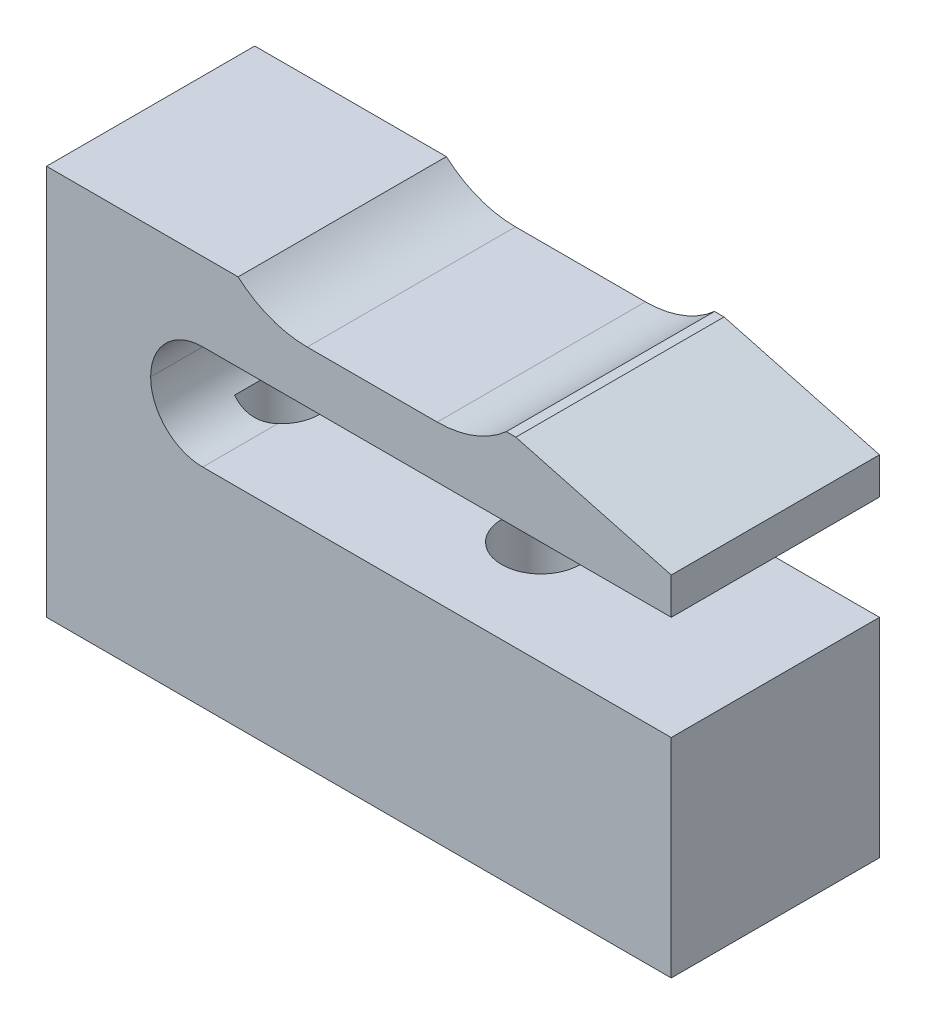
ISO-10303-21;
HEADER;
FILE_DESCRIPTION(('STEP AP214'),'2;1');
FILE_NAME('part.step','',(''),(''),'','','');
FILE_SCHEMA(('AUTOMOTIVE_DESIGN { 1 0 10303 214 1 1 1 1 }'));
ENDSEC;
DATA;
#1=APPLICATION_CONTEXT('core data for automotive mechanical design processes');
#2=APPLICATION_PROTOCOL_DEFINITION('international standard','automotive_design',2000,#1);
#3=PRODUCT_CONTEXT('',#1,'mechanical');
#4=PRODUCT('Part','Part','',(#3));
#5=PRODUCT_RELATED_PRODUCT_CATEGORY('part','',(#4));
#6=PRODUCT_DEFINITION_FORMATION('','',#4);
#7=PRODUCT_DEFINITION_CONTEXT('part definition',#1,'design');
#8=PRODUCT_DEFINITION('design','',#6,#7);
#9=PRODUCT_DEFINITION_SHAPE('','',#8);
#10=(LENGTH_UNIT() NAMED_UNIT(*) SI_UNIT(.MILLI.,.METRE.));
#11=(NAMED_UNIT(*) PLANE_ANGLE_UNIT() SI_UNIT($,.RADIAN.));
#12=(NAMED_UNIT(*) SI_UNIT($,.STERADIAN.) SOLID_ANGLE_UNIT());
#13=UNCERTAINTY_MEASURE_WITH_UNIT(LENGTH_MEASURE(1.E-05),#10,'distance_accuracy_value','');
#14=(GEOMETRIC_REPRESENTATION_CONTEXT(3) GLOBAL_UNCERTAINTY_ASSIGNED_CONTEXT((#13)) GLOBAL_UNIT_ASSIGNED_CONTEXT((#10,
#11,#12)) REPRESENTATION_CONTEXT('',''));
#15=CARTESIAN_POINT('',(0.,0.,0.));
#16=DIRECTION('',(0.,0.,1.));
#17=DIRECTION('',(1.,0.,0.));
#18=AXIS2_PLACEMENT_3D('',#15,#16,#17);
#19=CARTESIAN_POINT('',(0.,0.,6.35));
#20=DIRECTION('',(0.,1.,0.));
#21=DIRECTION('',(0.,0.,1.));
#22=AXIS2_PLACEMENT_3D('',#19,#20,#21);
#23=PLANE('',#22);
#24=CARTESIAN_POINT('',(7.9248,0.,0.));
#25=DIRECTION('',(0.,1.,0.));
#26=DIRECTION('',(0.,0.,1.));
#27=AXIS2_PLACEMENT_3D('',#24,#25,#26);
#28=CIRCLE('',#27,2.3876);
#29=CARTESIAN_POINT('',(7.9248,0.,2.3876));
#30=VERTEX_POINT('',#29);
#31=EDGE_CURVE('E157',#30,#30,#28,.T.);
#32=ORIENTED_EDGE('',*,*,#31,.T.);
#33=EDGE_LOOP('',(#32));
#34=FACE_BOUND('',#33,.T.);
#35=DIRECTION('',(1.,0.,0.));
#36=VECTOR('',#35,1.);
#37=CARTESIAN_POINT('',(0.,0.,-6.35));
#38=LINE('',#37,#36);
#39=CARTESIAN_POINT('',(0.,0.,-6.35));
#40=VERTEX_POINT('',#39);
#41=CARTESIAN_POINT('',(38.1,0.,-6.35));
#42=VERTEX_POINT('',#41);
#43=EDGE_CURVE('E268',#40,#42,#38,.T.);
#44=ORIENTED_EDGE('',*,*,#43,.T.);
#45=DIRECTION('',(0.,0.,-1.));
#46=VECTOR('',#45,1.);
#47=CARTESIAN_POINT('',(38.1,0.,6.35));
#48=LINE('',#47,#46);
#49=CARTESIAN_POINT('',(38.1,0.,6.35));
#50=VERTEX_POINT('',#49);
#51=EDGE_CURVE('E298',#50,#42,#48,.T.);
#52=ORIENTED_EDGE('',*,*,#51,.F.);
#53=DIRECTION('',(1.,0.,0.));
#54=VECTOR('',#53,1.);
#55=CARTESIAN_POINT('',(0.,0.,6.35));
#56=LINE('',#55,#54);
#57=CARTESIAN_POINT('',(0.,0.,6.35));
#58=VERTEX_POINT('',#57);
#59=EDGE_CURVE('E326',#58,#50,#56,.T.);
#60=ORIENTED_EDGE('',*,*,#59,.F.);
#61=DIRECTION('',(0.,0.,-1.));
#62=VECTOR('',#61,1.);
#63=CARTESIAN_POINT('',(0.,0.,6.35));
#64=LINE('',#63,#62);
#65=EDGE_CURVE('E264',#58,#40,#64,.T.);
#66=ORIENTED_EDGE('',*,*,#65,.T.);
#67=EDGE_LOOP('',(#44,#52,#60,#66));
#68=FACE_BOUND('',#67,.T.);
#69=CARTESIAN_POINT('',(23.7998,0.,0.));
#70=DIRECTION('',(0.,1.,0.));
#71=DIRECTION('',(0.,0.,1.));
#72=AXIS2_PLACEMENT_3D('',#69,#70,#71);
#73=CIRCLE('',#72,2.3876);
#74=CARTESIAN_POINT('',(23.7998,0.,2.3876));
#75=VERTEX_POINT('',#74);
#76=EDGE_CURVE('E362',#75,#75,#73,.T.);
#77=ORIENTED_EDGE('',*,*,#76,.T.);
#78=EDGE_LOOP('',(#77));
#79=FACE_BOUND('',#78,.T.);
#80=ADVANCED_FACE('F33',(#34,#68,#79),#23,.F.);
#81=CARTESIAN_POINT('',(38.1,12.7,6.35));
#82=DIRECTION('',(0.,-1.,0.));
#83=DIRECTION('',(1.,0.,0.));
#84=AXIS2_PLACEMENT_3D('',#81,#82,#83);
#85=PLANE('',#84);
#86=CARTESIAN_POINT('',(7.9248,12.7,0.));
#87=DIRECTION('',(0.,-1.,0.));
#88=DIRECTION('',(1.,0.,0.));
#89=AXIS2_PLACEMENT_3D('',#86,#87,#88);
#90=CIRCLE('',#89,2.3876);
#91=CARTESIAN_POINT('',(9.525,12.7,1.77200274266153));
#92=VERTEX_POINT('',#91);
#93=CARTESIAN_POINT('',(9.525,12.7,-1.77200274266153));
#94=VERTEX_POINT('',#93);
#95=EDGE_CURVE('E156',#92,#94,#90,.F.);
#96=ORIENTED_EDGE('',*,*,#95,.F.);
#97=DIRECTION('',(0.,0.,-1.));
#98=VECTOR('',#97,1.);
#99=CARTESIAN_POINT('',(9.525,12.7,6.35));
#100=LINE('',#99,#98);
#101=CARTESIAN_POINT('',(9.525,12.7,6.35));
#102=VERTEX_POINT('',#101);
#103=EDGE_CURVE('E162',#92,#102,#100,.F.);
#104=ORIENTED_EDGE('',*,*,#103,.T.);
#105=DIRECTION('',(-1.,0.,0.));
#106=VECTOR('',#105,1.);
#107=CARTESIAN_POINT('',(38.1,12.7,6.35));
#108=LINE('',#107,#106);
#109=CARTESIAN_POINT('',(38.1,12.7,6.35));
#110=VERTEX_POINT('',#109);
#111=EDGE_CURVE('E330',#110,#102,#108,.T.);
#112=ORIENTED_EDGE('',*,*,#111,.F.);
#113=DIRECTION('',(0.,0.,-1.));
#114=VECTOR('',#113,1.);
#115=CARTESIAN_POINT('',(38.1,12.7,6.35));
#116=LINE('',#115,#114);
#117=CARTESIAN_POINT('',(38.1,12.7,-6.35));
#118=VERTEX_POINT('',#117);
#119=EDGE_CURVE('E295',#110,#118,#116,.T.);
#120=ORIENTED_EDGE('',*,*,#119,.T.);
#121=DIRECTION('',(-1.,0.,0.));
#122=VECTOR('',#121,1.);
#123=CARTESIAN_POINT('',(38.1,12.7,-6.35));
#124=LINE('',#123,#122);
#125=CARTESIAN_POINT('',(9.525,12.7,-6.35));
#126=VERTEX_POINT('',#125);
#127=EDGE_CURVE('E280',#118,#126,#124,.T.);
#128=ORIENTED_EDGE('',*,*,#127,.T.);
#129=EDGE_CURVE('E168',#126,#94,#100,.F.);
#130=ORIENTED_EDGE('',*,*,#129,.T.);
#131=EDGE_LOOP('',(#96,#104,#112,#120,#128,#130));
#132=FACE_BOUND('',#131,.T.);
#133=CARTESIAN_POINT('',(23.7998,12.7,0.));
#134=DIRECTION('',(0.,-1.,0.));
#135=DIRECTION('',(1.,0.,0.));
#136=AXIS2_PLACEMENT_3D('',#133,#134,#135);
#137=CIRCLE('',#136,2.3876);
#138=CARTESIAN_POINT('',(26.1874,12.7,0.));
#139=VERTEX_POINT('',#138);
#140=EDGE_CURVE('E37',#139,#139,#137,.F.);
#141=ORIENTED_EDGE('',*,*,#140,.F.);
#142=EDGE_LOOP('',(#141));
#143=FACE_BOUND('',#142,.T.);
#144=ADVANCED_FACE('F242',(#132,#143),#85,.F.);
#145=CARTESIAN_POINT('',(9.525,15.875,6.35));
#146=DIRECTION('',(0.,0.,1.));
#147=DIRECTION('',(1.,0.,0.));
#148=AXIS2_PLACEMENT_3D('',#145,#146,#147);
#149=CYLINDRICAL_SURFACE('',#148,3.175);
#150=CARTESIAN_POINT('',(7.46149424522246,13.462,2.34221722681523));
#151=CARTESIAN_POINT('',(7.50892045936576,13.4214352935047,2.3516006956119));
#152=CARTESIAN_POINT('',(7.55770639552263,13.3821444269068,2.35975117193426));
#153=CARTESIAN_POINT('',(7.65781531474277,13.3063067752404,2.37316333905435));
#154=CARTESIAN_POINT('',(7.70914066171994,13.2697626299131,2.37842228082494));
#155=CARTESIAN_POINT('',(7.81431444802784,13.1995195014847,2.38562689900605));
#156=CARTESIAN_POINT('',(7.86817410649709,13.1658354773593,2.3875560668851));
#157=CARTESIAN_POINT('',(7.977787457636,13.101771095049,2.38764254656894));
#158=CARTESIAN_POINT('',(8.03354057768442,13.0713897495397,2.38580098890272));
#159=CARTESIAN_POINT('',(8.20376806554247,12.9851674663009,2.37397298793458));
#160=CARTESIAN_POINT('',(8.32064566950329,12.9346253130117,2.35763620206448));
#161=CARTESIAN_POINT('',(8.55544277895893,12.8490853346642,2.30593075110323));
#162=CARTESIAN_POINT('',(8.67335772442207,12.8140380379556,2.27062346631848));
#163=CARTESIAN_POINT('',(8.89313254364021,12.7616730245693,2.18526976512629));
#164=CARTESIAN_POINT('',(8.99539096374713,12.7428957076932,2.13712711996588));
#165=CARTESIAN_POINT('',(9.19312584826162,12.7158129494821,2.0260451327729));
#166=CARTESIAN_POINT('',(9.28859504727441,12.7075185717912,1.96309024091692));
#167=CARTESIAN_POINT('',(9.4697937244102,12.6991807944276,1.82392480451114));
#168=CARTESIAN_POINT('',(9.55551402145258,12.6991451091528,1.74770193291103));
#169=CARTESIAN_POINT('',(9.71504374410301,12.7046864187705,1.58390173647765));
#170=CARTESIAN_POINT('',(9.78885146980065,12.7102642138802,1.49632279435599));
#171=CARTESIAN_POINT('',(9.93032847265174,12.7250898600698,1.3017186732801));
#172=CARTESIAN_POINT('',(9.99648197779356,12.734668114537,1.19361502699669));
#173=CARTESIAN_POINT('',(10.1108936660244,12.7539856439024,0.968301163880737));
#174=CARTESIAN_POINT('',(10.159144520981,12.7637249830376,0.851087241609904));
#175=CARTESIAN_POINT('',(10.2390131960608,12.7810369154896,0.602604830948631));
#176=CARTESIAN_POINT('',(10.2693758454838,12.7884319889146,0.470916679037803));
#177=CARTESIAN_POINT('',(10.3074677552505,12.7978638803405,0.204141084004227));
#178=CARTESIAN_POINT('',(10.3152038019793,12.7999023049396,0.0690546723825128));
#179=CARTESIAN_POINT('',(10.30788256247,12.7980330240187,-0.197017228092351));
#180=CARTESIAN_POINT('',(10.2933974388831,12.7942745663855,-0.32801994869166));
#181=CARTESIAN_POINT('',(10.2431730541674,12.782184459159,-0.585677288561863));
#182=CARTESIAN_POINT('',(10.2074284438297,12.7738516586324,-0.712330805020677));
#183=CARTESIAN_POINT('',(10.1155880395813,12.7550608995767,-0.958321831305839));
#184=CARTESIAN_POINT('',(10.0594254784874,12.744596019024,-1.07763382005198));
#185=CARTESIAN_POINT('',(9.92817520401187,12.7250055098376,-1.30553327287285));
#186=CARTESIAN_POINT('',(9.85308179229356,12.7158802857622,-1.41411749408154));
#187=CARTESIAN_POINT('',(9.68396681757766,12.7028254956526,-1.61990057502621));
#188=CARTESIAN_POINT('',(9.58956642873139,12.699014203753,-1.71679769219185));
#189=CARTESIAN_POINT('',(9.38581142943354,12.7014242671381,-1.89319509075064));
#190=CARTESIAN_POINT('',(9.27646959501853,12.7076370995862,-1.97271008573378));
#191=CARTESIAN_POINT('',(9.05642352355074,12.7329773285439,-2.10600373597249));
#192=CARTESIAN_POINT('',(8.94654225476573,12.7510213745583,-2.1613421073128));
#193=CARTESIAN_POINT('',(8.72240401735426,12.800979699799,-2.25369064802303));
#194=CARTESIAN_POINT('',(8.60815153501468,12.8328800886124,-2.29071909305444));
#195=CARTESIAN_POINT('',(8.39086250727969,12.907454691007,-2.3440942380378));
#196=CARTESIAN_POINT('',(8.28777085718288,12.9488513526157,-2.3620438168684));
#197=CARTESIAN_POINT('',(8.08524314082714,13.0430025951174,-2.38438356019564));
#198=CARTESIAN_POINT('',(7.98581218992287,13.0957724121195,-2.38875541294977));
#199=CARTESIAN_POINT('',(7.81362095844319,13.1992423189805,-2.38622315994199));
#200=CARTESIAN_POINT('',(7.73965175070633,13.2480405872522,-2.38149857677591));
#201=CARTESIAN_POINT('',(7.59673576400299,13.351077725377,-2.36604268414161));
#202=CARTESIAN_POINT('',(7.52776894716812,13.4052925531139,-2.35533702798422));
#203=CARTESIAN_POINT('',(7.46149424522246,13.462,-2.34221722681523));
#204=B_SPLINE_CURVE_WITH_KNOTS('',3,(#150,#151,#152,#153,#154,#155,#156,#157,#158,#159,#160,
#161,#162,#163,#164,#165,#166,#167,#168,#169,#170,#171,#172,#173,#174,#175,#176,#177,#178,#179,
#180,#181,#182,#183,#184,#185,#186,#187,#188,#189,#190,#191,#192,#193,#194,#195,#196,#197,#198,
#199,#200,#201,#202,#203),.UNSPECIFIED.,.F.,.F.,(4,2,2,2,2,2,2,2,2,2,2,2,2,2,2,2,2,2,2,2,2,2,2,
2,2,2,4),(0.,0.189317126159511,0.378813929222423,0.569247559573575,0.759624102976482,
1.14239202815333,1.52392887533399,1.86597578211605,2.20838338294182,2.55111082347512,
2.89388712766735,3.27355778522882,3.65338368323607,4.05740214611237,4.46129941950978,
4.85497010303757,5.24873988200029,5.64380905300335,6.03899728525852,6.44284809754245,
6.84635572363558,7.21728044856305,7.58783419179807,7.92393353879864,8.26048597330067,
8.52620656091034,8.7907961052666),.UNSPECIFIED.);
#205=CARTESIAN_POINT('',(7.46149424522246,13.462,2.34221722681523));
#206=VERTEX_POINT('',#205);
#207=EDGE_CURVE('E11',#206,#92,#204,.T.);
#208=ORIENTED_EDGE('',*,*,#207,.F.);
#209=DIRECTION('',(0.,0.,1.));
#210=VECTOR('',#209,1.);
#211=CARTESIAN_POINT('',(7.46149424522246,13.462,6.35));
#212=LINE('',#211,#210);
#213=CARTESIAN_POINT('',(7.46149424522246,13.462,-2.34221722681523));
#214=VERTEX_POINT('',#213);
#215=EDGE_CURVE('E146',#206,#214,#212,.F.);
#216=ORIENTED_EDGE('',*,*,#215,.T.);
#217=EDGE_CURVE('E42',#94,#214,#204,.T.);
#218=ORIENTED_EDGE('',*,*,#217,.F.);
#219=ORIENTED_EDGE('',*,*,#129,.F.);
#220=CARTESIAN_POINT('',(9.525,15.875,-6.35));
#221=DIRECTION('',(0.,0.,1.));
#222=DIRECTION('',(1.,0.,0.));
#223=AXIS2_PLACEMENT_3D('',#220,#221,#222);
#224=CIRCLE('',#223,3.175);
#225=CARTESIAN_POINT('',(6.35,15.875,-6.35));
#226=VERTEX_POINT('',#225);
#227=EDGE_CURVE('E179',#226,#126,#224,.T.);
#228=ORIENTED_EDGE('',*,*,#227,.F.);
#229=DIRECTION('',(0.,0.,-1.));
#230=VECTOR('',#229,1.);
#231=CARTESIAN_POINT('',(6.35,15.875,6.35));
#232=LINE('',#231,#230);
#233=CARTESIAN_POINT('',(6.35,15.875,6.35));
#234=VERTEX_POINT('',#233);
#235=EDGE_CURVE('E187',#226,#234,#232,.F.);
#236=ORIENTED_EDGE('',*,*,#235,.T.);
#237=CARTESIAN_POINT('',(9.525,15.875,6.35));
#238=DIRECTION('',(0.,0.,1.));
#239=DIRECTION('',(1.,0.,0.));
#240=AXIS2_PLACEMENT_3D('',#237,#238,#239);
#241=CIRCLE('',#240,3.175);
#242=EDGE_CURVE('E164',#102,#234,#241,.F.);
#243=ORIENTED_EDGE('',*,*,#242,.F.);
#244=ORIENTED_EDGE('',*,*,#103,.F.);
#245=EDGE_LOOP('',(#208,#216,#218,#219,#228,#236,#243,#244));
#246=FACE_BOUND('',#245,.T.);
#247=ADVANCED_FACE('F160',(#246),#149,.F.);
#248=CARTESIAN_POINT('',(38.1,23.8252,6.35));
#249=DIRECTION('',(0.,-1.,0.));
#250=DIRECTION('',(1.,0.,0.));
#251=AXIS2_PLACEMENT_3D('',#248,#249,#250);
#252=PLANE('',#251);
#253=DIRECTION('',(-1.,0.,0.));
#254=VECTOR('',#253,1.);
#255=CARTESIAN_POINT('',(38.1,23.8252,6.35));
#256=LINE('',#255,#254);
#257=CARTESIAN_POINT('',(11.6859130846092,23.8252,6.35));
#258=VERTEX_POINT('',#257);
#259=CARTESIAN_POINT('',(0.,23.8252,6.35));
#260=VERTEX_POINT('',#259);
#261=EDGE_CURVE('E334',#258,#260,#256,.T.);
#262=ORIENTED_EDGE('',*,*,#261,.F.);
#263=DIRECTION('',(0.,0.,1.));
#264=VECTOR('',#263,1.);
#265=CARTESIAN_POINT('',(11.6859130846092,23.8252,-12.7));
#266=LINE('',#265,#264);
#267=CARTESIAN_POINT('',(11.6859130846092,23.8252,-6.35));
#268=VERTEX_POINT('',#267);
#269=EDGE_CURVE('E273',#258,#268,#266,.F.);
#270=ORIENTED_EDGE('',*,*,#269,.T.);
#271=DIRECTION('',(-1.,0.,0.));
#272=VECTOR('',#271,1.);
#273=CARTESIAN_POINT('',(38.1,23.8252,-6.35));
#274=LINE('',#273,#272);
#275=CARTESIAN_POINT('',(0.,23.8252,-6.35));
#276=VERTEX_POINT('',#275);
#277=EDGE_CURVE('E287',#268,#276,#274,.T.);
#278=ORIENTED_EDGE('',*,*,#277,.T.);
#279=DIRECTION('',(0.,0.,-1.));
#280=VECTOR('',#279,1.);
#281=CARTESIAN_POINT('',(0.,23.8252,6.35));
#282=LINE('',#281,#280);
#283=EDGE_CURVE('E266',#260,#276,#282,.T.);
#284=ORIENTED_EDGE('',*,*,#283,.F.);
#285=EDGE_LOOP('',(#262,#270,#278,#284));
#286=FACE_BOUND('',#285,.T.);
#287=ADVANCED_FACE('F234',(#286),#252,.F.);
#288=CARTESIAN_POINT('',(0.,23.8252,6.35));
#289=DIRECTION('',(1.,0.,0.));
#290=DIRECTION('',(0.,1.,0.));
#291=AXIS2_PLACEMENT_3D('',#288,#289,#290);
#292=PLANE('',#291);
#293=DIRECTION('',(0.,-1.,0.));
#294=VECTOR('',#293,1.);
#295=CARTESIAN_POINT('',(0.,23.8252,-6.35));
#296=LINE('',#295,#294);
#297=EDGE_CURVE('E261',#276,#40,#296,.T.);
#298=ORIENTED_EDGE('',*,*,#297,.T.);
#299=ORIENTED_EDGE('',*,*,#65,.F.);
#300=DIRECTION('',(0.,-1.,0.));
#301=VECTOR('',#300,1.);
#302=CARTESIAN_POINT('',(0.,23.8252,6.35));
#303=LINE('',#302,#301);
#304=EDGE_CURVE('E290',#260,#58,#303,.T.);
#305=ORIENTED_EDGE('',*,*,#304,.F.);
#306=ORIENTED_EDGE('',*,*,#283,.T.);
#307=EDGE_LOOP('',(#298,#299,#305,#306));
#308=FACE_BOUND('',#307,.T.);
#309=ADVANCED_FACE('F247',(#308),#292,.F.);
#310=CARTESIAN_POINT('',(38.1,0.,6.35));
#311=DIRECTION('',(-1.,0.,0.));
#312=DIRECTION('',(0.,0.,1.));
#313=AXIS2_PLACEMENT_3D('',#310,#311,#312);
#314=PLANE('',#313);
#315=DIRECTION('',(0.,1.,0.));
#316=VECTOR('',#315,1.);
#317=CARTESIAN_POINT('',(38.1,0.,-6.35));
#318=LINE('',#317,#316);
#319=EDGE_CURVE('E271',#42,#118,#318,.T.);
#320=ORIENTED_EDGE('',*,*,#319,.T.);
#321=ORIENTED_EDGE('',*,*,#119,.F.);
#322=DIRECTION('',(0.,1.,0.));
#323=VECTOR('',#322,1.);
#324=CARTESIAN_POINT('',(38.1,0.,6.35));
#325=LINE('',#324,#323);
#326=EDGE_CURVE('E328',#50,#110,#325,.T.);
#327=ORIENTED_EDGE('',*,*,#326,.F.);
#328=ORIENTED_EDGE('',*,*,#51,.T.);
#329=EDGE_LOOP('',(#320,#321,#327,#328));
#330=FACE_BOUND('',#329,.T.);
#331=ADVANCED_FACE('F240',(#330),#314,.F.);
#332=CARTESIAN_POINT('',(6.35,19.05,6.35));
#333=DIRECTION('',(0.,1.,0.));
#334=DIRECTION('',(0.,0.,1.));
#335=AXIS2_PLACEMENT_3D('',#332,#333,#334);
#336=PLANE('',#335);
#337=DIRECTION('',(1.,0.,0.));
#338=VECTOR('',#337,1.);
#339=CARTESIAN_POINT('',(6.35,19.05,6.35));
#340=LINE('',#339,#338);
#341=CARTESIAN_POINT('',(9.525,19.05,6.35));
#342=VERTEX_POINT('',#341);
#343=CARTESIAN_POINT('',(38.1,19.05,6.35));
#344=VERTEX_POINT('',#343);
#345=EDGE_CURVE('E332',#342,#344,#340,.T.);
#346=ORIENTED_EDGE('',*,*,#345,.F.);
#347=DIRECTION('',(0.,0.,-1.));
#348=VECTOR('',#347,1.);
#349=CARTESIAN_POINT('',(9.525,19.05,-6.35));
#350=LINE('',#349,#348);
#351=CARTESIAN_POINT('',(9.525,19.05,-6.35));
#352=VERTEX_POINT('',#351);
#353=EDGE_CURVE('E172',#342,#352,#350,.T.);
#354=ORIENTED_EDGE('',*,*,#353,.T.);
#355=DIRECTION('',(1.,0.,0.));
#356=VECTOR('',#355,1.);
#357=CARTESIAN_POINT('',(6.35,19.05,-6.35));
#358=LINE('',#357,#356);
#359=CARTESIAN_POINT('',(38.1,19.05,-6.35));
#360=VERTEX_POINT('',#359);
#361=EDGE_CURVE('E283',#352,#360,#358,.T.);
#362=ORIENTED_EDGE('',*,*,#361,.T.);
#363=DIRECTION('',(0.,0.,-1.));
#364=VECTOR('',#363,1.);
#365=CARTESIAN_POINT('',(38.1,19.05,6.35));
#366=LINE('',#365,#364);
#367=EDGE_CURVE('E292',#344,#360,#366,.T.);
#368=ORIENTED_EDGE('',*,*,#367,.F.);
#369=EDGE_LOOP('',(#346,#354,#362,#368));
#370=FACE_BOUND('',#369,.T.);
#371=ADVANCED_FACE('F237',(#370),#336,.F.);
#372=CARTESIAN_POINT('',(38.1,19.05,6.35));
#373=DIRECTION('',(-1.,0.,0.));
#374=DIRECTION('',(0.,0.,1.));
#375=AXIS2_PLACEMENT_3D('',#372,#373,#374);
#376=PLANE('',#375);
#377=DIRECTION('',(0.,1.,0.));
#378=VECTOR('',#377,1.);
#379=CARTESIAN_POINT('',(38.1,19.05,-6.35));
#380=LINE('',#379,#378);
#381=CARTESIAN_POINT('',(38.1,21.2852,-6.35));
#382=VERTEX_POINT('',#381);
#383=EDGE_CURVE('E285',#360,#382,#380,.T.);
#384=ORIENTED_EDGE('',*,*,#383,.T.);
#385=DIRECTION('',(0.,0.,1.));
#386=VECTOR('',#385,1.);
#387=CARTESIAN_POINT('',(38.1,21.2852,6.35));
#388=LINE('',#387,#386);
#389=CARTESIAN_POINT('',(38.1,21.2852,6.35));
#390=VERTEX_POINT('',#389);
#391=EDGE_CURVE('E56',#382,#390,#388,.T.);
#392=ORIENTED_EDGE('',*,*,#391,.T.);
#393=DIRECTION('',(0.,1.,0.));
#394=VECTOR('',#393,1.);
#395=CARTESIAN_POINT('',(38.1,19.05,6.35));
#396=LINE('',#395,#394);
#397=EDGE_CURVE('E333',#344,#390,#396,.T.);
#398=ORIENTED_EDGE('',*,*,#397,.F.);
#399=ORIENTED_EDGE('',*,*,#367,.T.);
#400=EDGE_LOOP('',(#384,#392,#398,#399));
#401=FACE_BOUND('',#400,.T.);
#402=ADVANCED_FACE('F232',(#401),#376,.F.);
#403=CARTESIAN_POINT('',(28.620590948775,23.8252,6.35));
#404=VERTEX_POINT('',#403);
#405=CARTESIAN_POINT('',(28.0396869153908,23.8252,6.35));
#406=VERTEX_POINT('',#405);
#407=EDGE_CURVE('E276',#404,#406,#256,.T.);
#408=ORIENTED_EDGE('',*,*,#407,.F.);
#409=DIRECTION('',(0.,0.,-1.));
#410=VECTOR('',#409,1.);
#411=CARTESIAN_POINT('',(28.620590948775,23.8252,6.35));
#412=LINE('',#411,#410);
#413=CARTESIAN_POINT('',(28.620590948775,23.8252,-6.35));
#414=VERTEX_POINT('',#413);
#415=EDGE_CURVE('E186',#404,#414,#412,.T.);
#416=ORIENTED_EDGE('',*,*,#415,.T.);
#417=CARTESIAN_POINT('',(28.0396869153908,23.8252,-6.35));
#418=VERTEX_POINT('',#417);
#419=EDGE_CURVE('E288',#414,#418,#274,.T.);
#420=ORIENTED_EDGE('',*,*,#419,.T.);
#421=DIRECTION('',(0.,0.,1.));
#422=VECTOR('',#421,1.);
#423=CARTESIAN_POINT('',(28.0396869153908,23.8252,-12.7));
#424=LINE('',#423,#422);
#425=EDGE_CURVE('E313',#418,#406,#424,.T.);
#426=ORIENTED_EDGE('',*,*,#425,.T.);
#427=EDGE_LOOP('',(#408,#416,#420,#426));
#428=FACE_BOUND('',#427,.T.);
#429=ADVANCED_FACE('F225',(#428),#252,.F.);
#430=CARTESIAN_POINT('',(0.,0.,6.35));
#431=DIRECTION('',(0.,0.,1.));
#432=DIRECTION('',(1.,0.,0.));
#433=AXIS2_PLACEMENT_3D('',#430,#431,#432);
#434=PLANE('',#433);
#435=ORIENTED_EDGE('',*,*,#397,.T.);
#436=DIRECTION('',(0.965925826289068,-0.258819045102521,0.));
#437=VECTOR('',#436,1.);
#438=CARTESIAN_POINT('',(7.87351605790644,29.3843619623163,6.35));
#439=LINE('',#438,#437);
#440=EDGE_CURVE('E151',#390,#404,#439,.F.);
#441=ORIENTED_EDGE('',*,*,#440,.T.);
#442=ORIENTED_EDGE('',*,*,#407,.T.);
#443=CARTESIAN_POINT('',(23.8252,28.575,6.35));
#444=DIRECTION('',(0.,0.,1.));
#445=DIRECTION('',(1.,0.,0.));
#446=AXIS2_PLACEMENT_3D('',#443,#444,#445);
#447=CIRCLE('',#446,6.35);
#448=CARTESIAN_POINT('',(23.8252,22.225,6.35));
#449=VERTEX_POINT('',#448);
#450=EDGE_CURVE('E314',#449,#406,#447,.T.);
#451=ORIENTED_EDGE('',*,*,#450,.F.);
#452=DIRECTION('',(1.,0.,0.));
#453=VECTOR('',#452,1.);
#454=CARTESIAN_POINT('',(0.,22.225,6.35));
#455=LINE('',#454,#453);
#456=CARTESIAN_POINT('',(15.9004,22.225,6.35));
#457=VERTEX_POINT('',#456);
#458=EDGE_CURVE('E316',#457,#449,#455,.T.);
#459=ORIENTED_EDGE('',*,*,#458,.F.);
#460=CARTESIAN_POINT('',(15.9004,28.575,6.35));
#461=DIRECTION('',(0.,0.,1.));
#462=DIRECTION('',(1.,0.,0.));
#463=AXIS2_PLACEMENT_3D('',#460,#461,#462);
#464=CIRCLE('',#463,6.35);
#465=EDGE_CURVE('E269',#258,#457,#464,.T.);
#466=ORIENTED_EDGE('',*,*,#465,.F.);
#467=ORIENTED_EDGE('',*,*,#261,.T.);
#468=ORIENTED_EDGE('',*,*,#304,.T.);
#469=ORIENTED_EDGE('',*,*,#59,.T.);
#470=ORIENTED_EDGE('',*,*,#326,.T.);
#471=ORIENTED_EDGE('',*,*,#111,.T.);
#472=ORIENTED_EDGE('',*,*,#242,.T.);
#473=CARTESIAN_POINT('',(9.525,15.875,6.35));
#474=DIRECTION('',(0.,0.,1.));
#475=DIRECTION('',(1.,0.,0.));
#476=AXIS2_PLACEMENT_3D('',#473,#474,#475);
#477=CIRCLE('',#476,3.175);
#478=EDGE_CURVE('E184',#234,#342,#477,.F.);
#479=ORIENTED_EDGE('',*,*,#478,.T.);
#480=ORIENTED_EDGE('',*,*,#345,.T.);
#481=EDGE_LOOP('',(#435,#441,#442,#451,#459,#466,#467,#468,#469,#470,#471,#472,#479,#480));
#482=FACE_BOUND('',#481,.T.);
#483=ADVANCED_FACE('F222',(#482),#434,.T.);
#484=CARTESIAN_POINT('',(0.,0.,-6.35));
#485=DIRECTION('',(0.,0.,1.));
#486=DIRECTION('',(1.,0.,0.));
#487=AXIS2_PLACEMENT_3D('',#484,#485,#486);
#488=PLANE('',#487);
#489=ORIENTED_EDGE('',*,*,#419,.F.);
#490=DIRECTION('',(-0.965925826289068,0.258819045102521,0.));
#491=VECTOR('',#490,1.);
#492=CARTESIAN_POINT('',(28.620590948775,23.8252,-6.35));
#493=LINE('',#492,#491);
#494=EDGE_CURVE('E192',#414,#382,#493,.F.);
#495=ORIENTED_EDGE('',*,*,#494,.T.);
#496=ORIENTED_EDGE('',*,*,#383,.F.);
#497=ORIENTED_EDGE('',*,*,#361,.F.);
#498=CARTESIAN_POINT('',(9.525,15.875,-6.35));
#499=DIRECTION('',(0.,0.,1.));
#500=DIRECTION('',(1.,0.,0.));
#501=AXIS2_PLACEMENT_3D('',#498,#499,#500);
#502=CIRCLE('',#501,3.175);
#503=EDGE_CURVE('E182',#352,#226,#502,.T.);
#504=ORIENTED_EDGE('',*,*,#503,.T.);
#505=ORIENTED_EDGE('',*,*,#227,.T.);
#506=ORIENTED_EDGE('',*,*,#127,.F.);
#507=ORIENTED_EDGE('',*,*,#319,.F.);
#508=ORIENTED_EDGE('',*,*,#43,.F.);
#509=ORIENTED_EDGE('',*,*,#297,.F.);
#510=ORIENTED_EDGE('',*,*,#277,.F.);
#511=CARTESIAN_POINT('',(15.9004,28.575,-6.35));
#512=DIRECTION('',(0.,0.,1.));
#513=DIRECTION('',(1.,0.,0.));
#514=AXIS2_PLACEMENT_3D('',#511,#512,#513);
#515=CIRCLE('',#514,6.35);
#516=CARTESIAN_POINT('',(15.9004,22.225,-6.35));
#517=VERTEX_POINT('',#516);
#518=EDGE_CURVE('E169',#268,#517,#515,.T.);
#519=ORIENTED_EDGE('',*,*,#518,.T.);
#520=DIRECTION('',(1.,0.,0.));
#521=VECTOR('',#520,1.);
#522=CARTESIAN_POINT('',(0.,22.225,-6.35));
#523=LINE('',#522,#521);
#524=CARTESIAN_POINT('',(23.8252,22.225,-6.35));
#525=VERTEX_POINT('',#524);
#526=EDGE_CURVE('E302',#517,#525,#523,.T.);
#527=ORIENTED_EDGE('',*,*,#526,.T.);
#528=CARTESIAN_POINT('',(23.8252,28.575,-6.35));
#529=DIRECTION('',(0.,0.,1.));
#530=DIRECTION('',(1.,0.,0.));
#531=AXIS2_PLACEMENT_3D('',#528,#529,#530);
#532=CIRCLE('',#531,6.35);
#533=EDGE_CURVE('E174',#525,#418,#532,.T.);
#534=ORIENTED_EDGE('',*,*,#533,.T.);
#535=EDGE_LOOP('',(#489,#495,#496,#497,#504,#505,#506,#507,#508,#509,#510,#519,#527,#534));
#536=FACE_BOUND('',#535,.T.);
#537=ADVANCED_FACE('F217',(#536),#488,.F.);
#538=CARTESIAN_POINT('',(15.9004,22.225,-12.7));
#539=DIRECTION('',(0.,-1.,0.));
#540=DIRECTION('',(0.,0.,-1.));
#541=AXIS2_PLACEMENT_3D('',#538,#539,#540);
#542=PLANE('',#541);
#543=ORIENTED_EDGE('',*,*,#458,.T.);
#544=DIRECTION('',(0.,0.,1.));
#545=VECTOR('',#544,1.);
#546=CARTESIAN_POINT('',(23.8252,22.225,-12.7));
#547=LINE('',#546,#545);
#548=EDGE_CURVE('E310',#525,#449,#547,.T.);
#549=ORIENTED_EDGE('',*,*,#548,.F.);
#550=ORIENTED_EDGE('',*,*,#526,.F.);
#551=DIRECTION('',(0.,0.,1.));
#552=VECTOR('',#551,1.);
#553=CARTESIAN_POINT('',(15.9004,22.225,-12.7));
#554=LINE('',#553,#552);
#555=EDGE_CURVE('E189',#517,#457,#554,.T.);
#556=ORIENTED_EDGE('',*,*,#555,.T.);
#557=EDGE_LOOP('',(#543,#549,#550,#556));
#558=FACE_BOUND('',#557,.T.);
#559=ADVANCED_FACE('F214',(#558),#542,.F.);
#560=CARTESIAN_POINT('',(15.9004,28.575,-12.7));
#561=DIRECTION('',(0.,0.,1.));
#562=DIRECTION('',(1.,0.,0.));
#563=AXIS2_PLACEMENT_3D('',#560,#561,#562);
#564=CYLINDRICAL_SURFACE('',#563,6.35);
#565=ORIENTED_EDGE('',*,*,#465,.T.);
#566=ORIENTED_EDGE('',*,*,#555,.F.);
#567=ORIENTED_EDGE('',*,*,#518,.F.);
#568=ORIENTED_EDGE('',*,*,#269,.F.);
#569=EDGE_LOOP('',(#565,#566,#567,#568));
#570=FACE_BOUND('',#569,.T.);
#571=ADVANCED_FACE('F212',(#570),#564,.F.);
#572=CARTESIAN_POINT('',(23.8252,28.575,-12.7));
#573=DIRECTION('',(0.,0.,1.));
#574=DIRECTION('',(1.,0.,0.));
#575=AXIS2_PLACEMENT_3D('',#572,#573,#574);
#576=CYLINDRICAL_SURFACE('',#575,6.35);
#577=ORIENTED_EDGE('',*,*,#450,.T.);
#578=ORIENTED_EDGE('',*,*,#425,.F.);
#579=ORIENTED_EDGE('',*,*,#533,.F.);
#580=ORIENTED_EDGE('',*,*,#548,.T.);
#581=EDGE_LOOP('',(#577,#578,#579,#580));
#582=FACE_BOUND('',#581,.T.);
#583=ADVANCED_FACE('F208',(#582),#576,.F.);
#584=CARTESIAN_POINT('',(9.525,15.875,6.35));
#585=DIRECTION('',(0.,0.,1.));
#586=DIRECTION('',(1.,0.,0.));
#587=AXIS2_PLACEMENT_3D('',#584,#585,#586);
#588=CYLINDRICAL_SURFACE('',#587,3.175);
#589=ORIENTED_EDGE('',*,*,#353,.F.);
#590=ORIENTED_EDGE('',*,*,#478,.F.);
#591=ORIENTED_EDGE('',*,*,#235,.F.);
#592=ORIENTED_EDGE('',*,*,#503,.F.);
#593=EDGE_LOOP('',(#589,#590,#591,#592));
#594=FACE_BOUND('',#593,.T.);
#595=ADVANCED_FACE('F211',(#594),#588,.F.);
#596=CARTESIAN_POINT('',(28.620590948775,23.8252,6.35));
#597=DIRECTION('',(-0.258819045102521,-0.965925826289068,0.));
#598=DIRECTION('',(0.,0.,-1.));
#599=AXIS2_PLACEMENT_3D('',#596,#597,#598);
#600=PLANE('',#599);
#601=ORIENTED_EDGE('',*,*,#440,.F.);
#602=ORIENTED_EDGE('',*,*,#391,.F.);
#603=ORIENTED_EDGE('',*,*,#494,.F.);
#604=ORIENTED_EDGE('',*,*,#415,.F.);
#605=EDGE_LOOP('',(#601,#602,#603,#604));
#606=FACE_BOUND('',#605,.T.);
#607=ADVANCED_FACE('F35',(#606),#600,.F.);
#608=CARTESIAN_POINT('',(7.9248,13.462,0.));
#609=DIRECTION('',(0.,-1.,0.));
#610=DIRECTION('',(0.,0.,-1.));
#611=AXIS2_PLACEMENT_3D('',#608,#609,#610);
#612=CYLINDRICAL_SURFACE('',#611,2.3876);
#613=ORIENTED_EDGE('',*,*,#31,.F.);
#614=EDGE_LOOP('',(#613));
#615=FACE_BOUND('',#614,.T.);
#616=ORIENTED_EDGE('',*,*,#207,.T.);
#617=ORIENTED_EDGE('',*,*,#95,.T.);
#618=ORIENTED_EDGE('',*,*,#217,.T.);
#619=CARTESIAN_POINT('',(7.9248,13.462,0.));
#620=DIRECTION('',(0.,1.,0.));
#621=DIRECTION('',(0.,0.,1.));
#622=AXIS2_PLACEMENT_3D('',#619,#620,#621);
#623=CIRCLE('',#622,2.3876);
#624=EDGE_CURVE('E48',#214,#206,#623,.T.);
#625=ORIENTED_EDGE('',*,*,#624,.T.);
#626=EDGE_LOOP('',(#616,#617,#618,#625));
#627=FACE_BOUND('',#626,.T.);
#628=ADVANCED_FACE('F154',(#615,#627),#612,.F.);
#629=CARTESIAN_POINT('',(7.9248,13.462,0.));
#630=DIRECTION('',(0.,1.,0.));
#631=DIRECTION('',(0.,0.,1.));
#632=AXIS2_PLACEMENT_3D('',#629,#630,#631);
#633=PLANE('',#632);
#634=ORIENTED_EDGE('',*,*,#624,.F.);
#635=ORIENTED_EDGE('',*,*,#215,.F.);
#636=EDGE_LOOP('',(#634,#635));
#637=FACE_BOUND('',#636,.T.);
#638=ADVANCED_FACE('F147',(#637),#633,.F.);
#639=CARTESIAN_POINT('',(23.7998,13.462,0.));
#640=DIRECTION('',(0.,-1.,0.));
#641=DIRECTION('',(0.,0.,-1.));
#642=AXIS2_PLACEMENT_3D('',#639,#640,#641);
#643=CYLINDRICAL_SURFACE('',#642,2.3876);
#644=ORIENTED_EDGE('',*,*,#76,.F.);
#645=EDGE_LOOP('',(#644));
#646=FACE_BOUND('',#645,.T.);
#647=ORIENTED_EDGE('',*,*,#140,.T.);
#648=EDGE_LOOP('',(#647));
#649=FACE_BOUND('',#648,.T.);
#650=ADVANCED_FACE('F375',(#646,#649),#643,.F.);
#651=CLOSED_SHELL('',(#80,#144,#247,#287,#309,#331,#371,#402,#429,#483,#537,#559,#571,#583,#595,
#607,#628,#638,#650));
#652=MANIFOLD_SOLID_BREP('B2',#651);
#653=ADVANCED_BREP_SHAPE_REPRESENTATION('',(#18,#652),#14);
#654=SHAPE_DEFINITION_REPRESENTATION(#9,#653);
ENDSEC;
END-ISO-10303-21;
